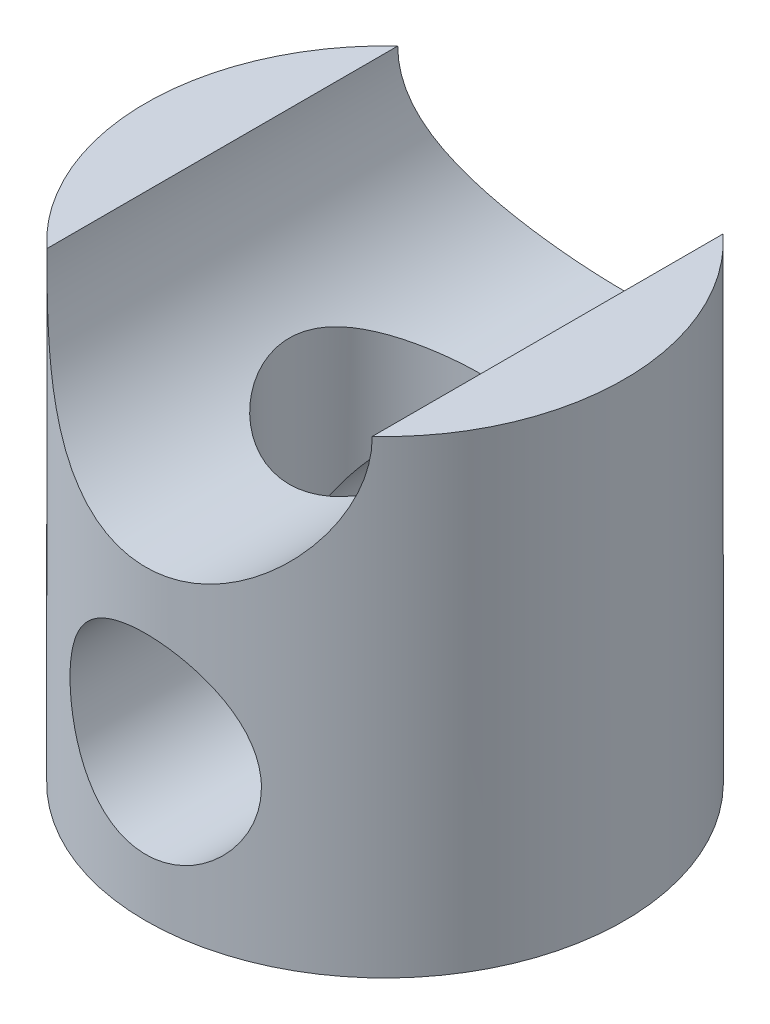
from build123d import *

# Parameters (mm, degrees)
SKETCH_1_R               = 100
EXTRUDE_1_DEPTH          = 196
CUT_EXTRUDE_1_DEPTH      = 242.69402144
CUT_EXTRUDE_1_DEPTH_BACK = 242.69402144
CUT_EXTRUDE_2_DEPTH      = 242.694021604
CUT_EXTRUDE_2_DEPTH_BACK = 242.694021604
SKETCH_3_R               = 40
SKETCH_4_R               = 40
CUT_EXTRUDE_3_DEPTH      = 242.694021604


with BuildPart() as part:
    # Sketch 1 → Extrude 1 (new body)
    with BuildSketch(Plane(origin=(0, 0, 0), x_dir=(1, 0, 0), z_dir=(0, 1, 0))):
        with Locations(Location((0, 0, 0), (0, 0, 270))):
            Circle(SKETCH_1_R)
    extrude(amount=EXTRUDE_1_DEPTH)

    # Sketch 2 → Cut-Extrude 1 (cut, two sides: drawn at the far end of the back side and taken through both)
    with BuildSketch(Plane.XY.offset(-CUT_EXTRUDE_1_DEPTH_BACK)):
        with BuildLine():
            Line((68, 196), (-68, 196))
            ThreePointArc((-68, 196), (0, 128), (68, 196))
        make_face()
    extrude(amount=CUT_EXTRUDE_1_DEPTH + CUT_EXTRUDE_1_DEPTH_BACK, mode=Mode.SUBTRACT)

    # Sketch 3 → Cut-Extrude 2 (cut, two sides: drawn at the far end of the back side and taken through both)
    with BuildSketch(Plane.XY.offset(-CUT_EXTRUDE_2_DEPTH_BACK)):
        with Locations((0, 64)):
            Circle(SKETCH_3_R)
    extrude(amount=CUT_EXTRUDE_2_DEPTH + CUT_EXTRUDE_2_DEPTH_BACK, mode=Mode.SUBTRACT)

    # Sketch 4 → Cut-Extrude 3 (cut, through all)
    with BuildSketch(Plane(origin=(0, 196, 0), x_dir=(1, 0, 0), z_dir=(0, 1, 0))):
        with Locations(Location((0, 0, 0), (0, 0, 270))):
            Circle(SKETCH_4_R)
    extrude(amount=-CUT_EXTRUDE_3_DEPTH, mode=Mode.SUBTRACT)


solid = part.part
